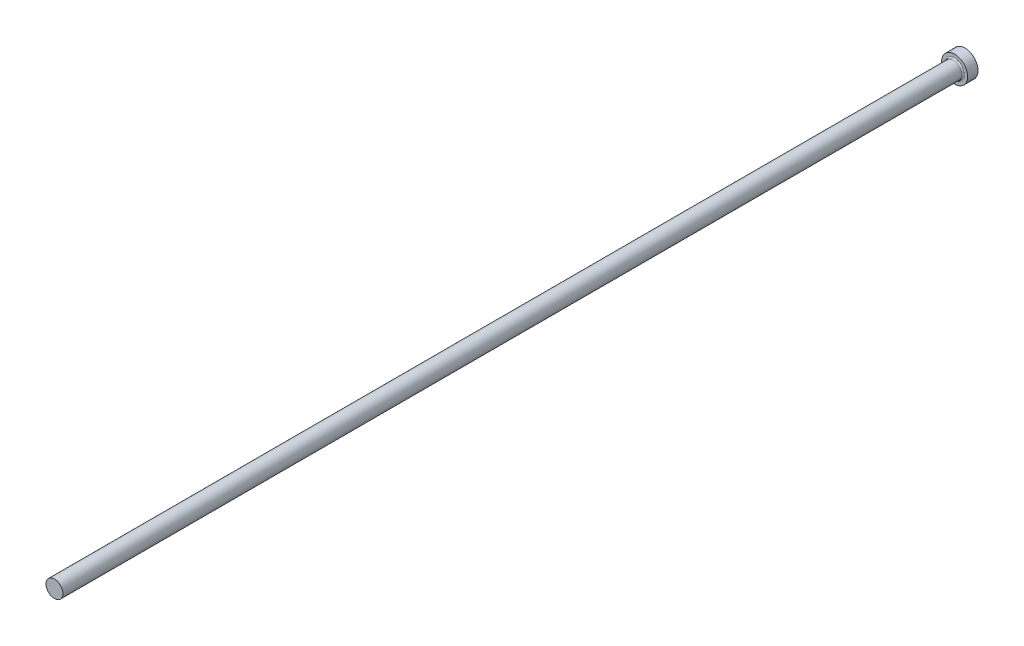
from build123d import *

# Parameters (mm, degrees)
FILLET1_R = 0.5


with BuildPart() as part:
    # FV → Revolve1 (revolve)
    with BuildSketch(Plane(origin=(0, 0, 0), x_dir=(1, 0, 0), z_dir=(0, 1, 0)), mode=Mode.PRIVATE) as revolve1_sk:
        Polygon((0, 0), (5, 0), (5, -4), (3.25, -4), (3.25, -350), (0, -350), align=None)
    revolve(revolve1_sk.sketch.rotate(Axis((0, 0, -9.033228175), (0, 0, 1)), 180), axis=Axis((0, 0, -9.033228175), (0, 0, 1)))

    # Fillet1
    fillet1_edges = [part.edges().sort_by_distance(p)[0] for p in [
        (3.25, 0, 4),
    ]]
    fillet(fillet1_edges, radius=FILLET1_R)


solid = part.part
